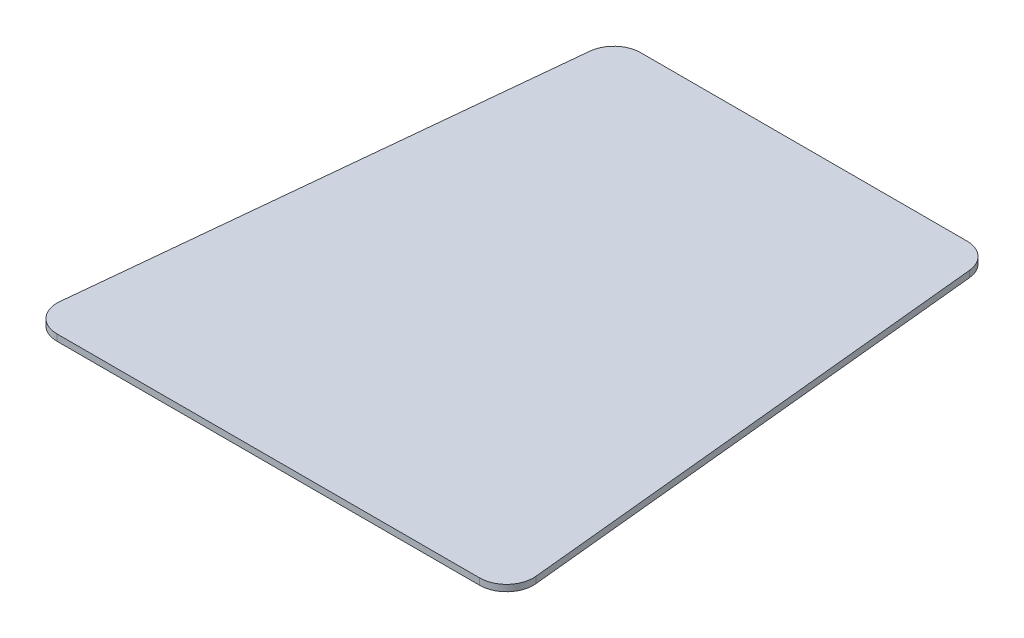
from build123d import *

# Parameters (mm, degrees)
EXTRUDE1_DEPTH = 1.524


with BuildPart() as part:
    # Sketch1 → Extrude1 (new body)
    with BuildSketch(Plane(origin=(0, 0, 0), x_dir=(1, 0, 0), z_dir=(0, 1, 0))):
        with BuildLine():
            Line((38.703328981, 0), (-38.703328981, 0))
            ThreePointArc((-38.703328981, 0), (-42.964212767, -1.641776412), (-45.021815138, -5.718151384))
            Line((-45.021815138, -5.718151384), (-56.451815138, -120.018151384))
            ThreePointArc((-56.451815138, -120.018151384), (-54.841552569, -124.910883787), (-50.133328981, -127))
            Line((-50.133328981, -127), (50.133328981, -127))
            ThreePointArc((50.133328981, -127), (54.841552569, -124.910883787), (56.451815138, -120.018151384))
            Line((56.451815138, -120.018151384), (45.021815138, -5.718151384))
            ThreePointArc((45.021815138, -5.718151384), (42.964212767, -1.641776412), (38.703328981, 0))
        make_face()
    extrude(amount=EXTRUDE1_DEPTH)


solid = part.part
